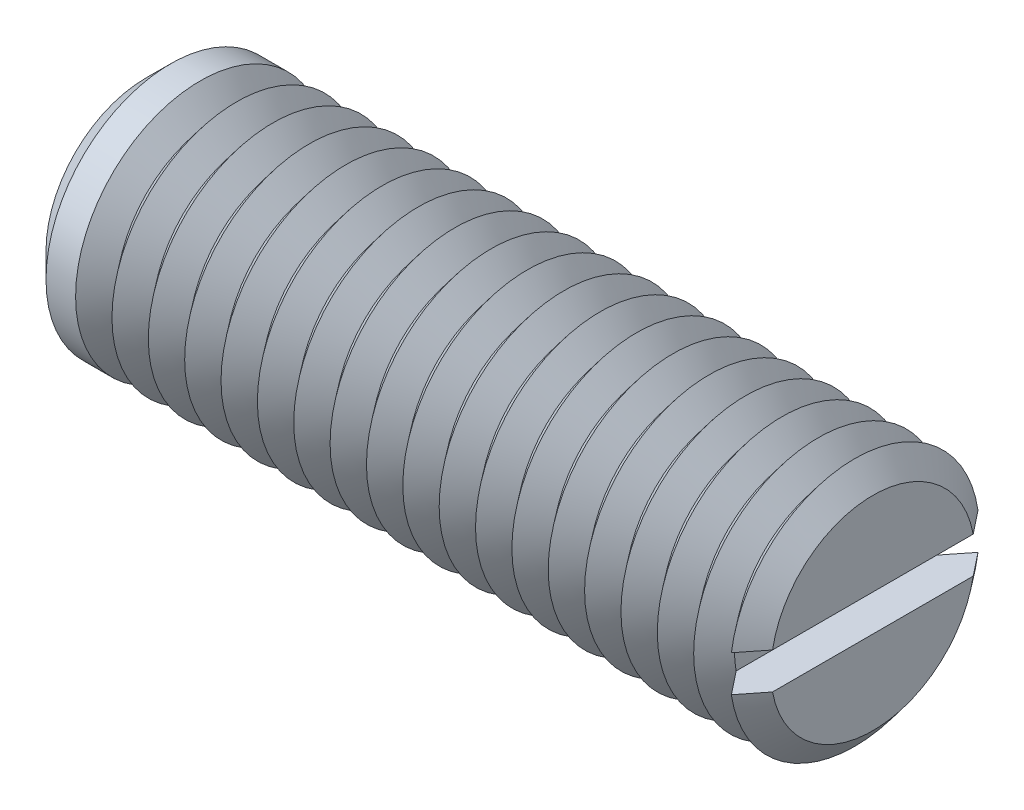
from build123d import *

# Parameters (mm, degrees)
SKETCH1_R       = 6
EXTRUDE1_DEPTH  = 17.5
SKETCH2_W       = 1.75
SKETCH2_H       = 1.75
EXTRUDE2_DEPTH  = 9
CHAMFER1_SIZE   = 1.2
LPATTERN1_COUNT = 19
LPATTERN1_PITCH = 1.75


with BuildPart() as part:
    # Sketch1 → Extrude1 (new, symmetric)
    with BuildSketch(Plane(origin=(0, 0, 0), x_dir=(0, 0, -1), z_dir=(1, 0, 0))):
        Circle(SKETCH1_R)
    extrude(amount=EXTRUDE1_DEPTH, both=True)

    # Sketch2 → Extrude2 (cut, symmetric)
    with BuildSketch(Plane.XY):
        with Locations((16.625, 0)):
            Rectangle(SKETCH2_W, SKETCH2_H)
    extrude(amount=EXTRUDE2_DEPTH, both=True, mode=Mode.SUBTRACT)

    # Chamfer1
    chamfer1_edges = [part.edges().sort_by_distance(p)[0] for p in [
        (-17.5, 0, 6),
    ]]
    chamfer(chamfer1_edges, length=CHAMFER1_SIZE)

    # Sketch3 → Cut-Revolve1 (revolve, cut)
    with BuildSketch(Plane.XY, mode=Mode.PRIVATE) as cut_revolve1_sk:
        Polygon((16.625, -6), (18.375, -6), (17.5, -4.90712535), align=None)
    cut_revolve1 = revolve(cut_revolve1_sk.sketch.rotate(Axis((0, 0, 0), (1, 0, 0)), 261.614461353), axis=Axis((0, 0, 0), (1, 0, 0)), mode=Mode.SUBTRACT)

    # LPattern1: Cut-Revolve1 ×19
    with Locations(*[(-i * LPATTERN1_PITCH, 0, 0) for i in range(1, LPATTERN1_COUNT)]):
        add(cut_revolve1, mode=Mode.SUBTRACT)


solid = part.part
